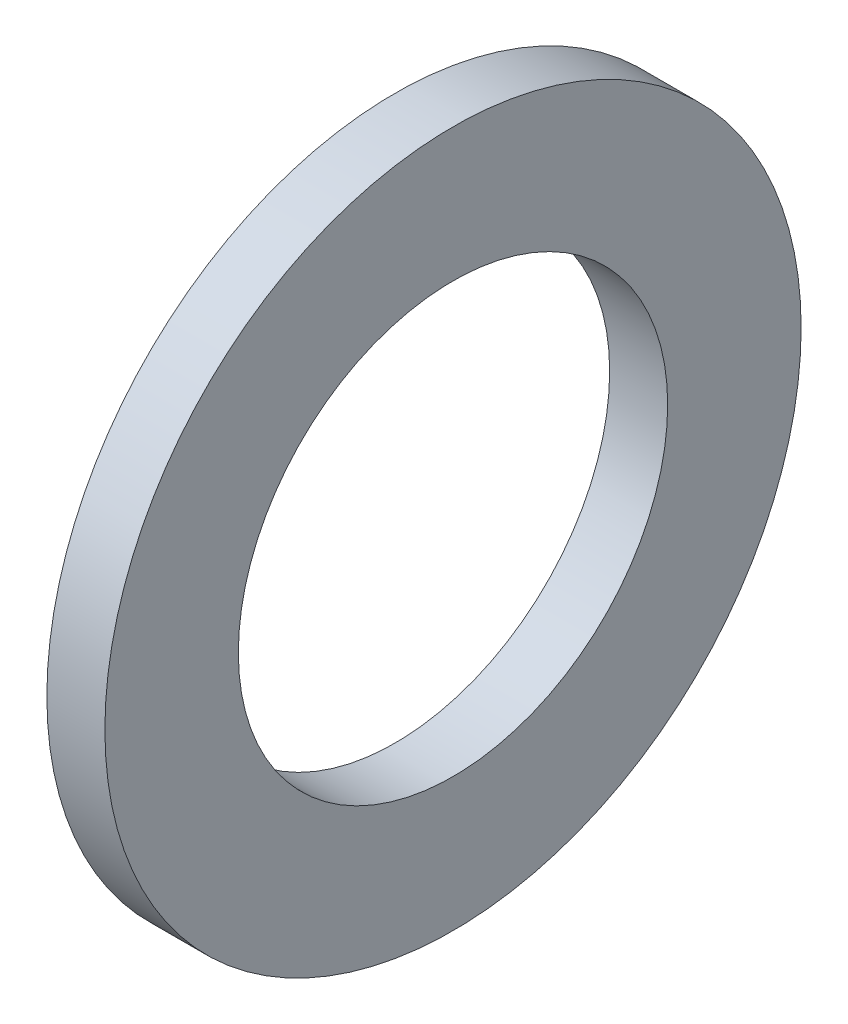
ISO-10303-21;
HEADER;
FILE_DESCRIPTION(('STEP AP214'),'2;1');
FILE_NAME('part.step','',(''),(''),'','','');
FILE_SCHEMA(('AUTOMOTIVE_DESIGN { 1 0 10303 214 1 1 1 1 }'));
ENDSEC;
DATA;
#1=APPLICATION_CONTEXT('core data for automotive mechanical design processes');
#2=APPLICATION_PROTOCOL_DEFINITION('international standard','automotive_design',2000,#1);
#3=PRODUCT_CONTEXT('',#1,'mechanical');
#4=PRODUCT('Part','Part','',(#3));
#5=PRODUCT_RELATED_PRODUCT_CATEGORY('part','',(#4));
#6=PRODUCT_DEFINITION_FORMATION('','',#4);
#7=PRODUCT_DEFINITION_CONTEXT('part definition',#1,'design');
#8=PRODUCT_DEFINITION('design','',#6,#7);
#9=PRODUCT_DEFINITION_SHAPE('','',#8);
#10=(LENGTH_UNIT() NAMED_UNIT(*) SI_UNIT(.MILLI.,.METRE.));
#11=(NAMED_UNIT(*) PLANE_ANGLE_UNIT() SI_UNIT($,.RADIAN.));
#12=(NAMED_UNIT(*) SI_UNIT($,.STERADIAN.) SOLID_ANGLE_UNIT());
#13=UNCERTAINTY_MEASURE_WITH_UNIT(LENGTH_MEASURE(1.E-05),#10,'distance_accuracy_value','');
#14=(GEOMETRIC_REPRESENTATION_CONTEXT(3) GLOBAL_UNCERTAINTY_ASSIGNED_CONTEXT((#13)) GLOBAL_UNIT_ASSIGNED_CONTEXT((#10,
#11,#12)) REPRESENTATION_CONTEXT('',''));
#15=CARTESIAN_POINT('',(0.,0.,0.));
#16=DIRECTION('',(0.,0.,1.));
#17=DIRECTION('',(1.,0.,0.));
#18=AXIS2_PLACEMENT_3D('',#15,#16,#17);
#19=CARTESIAN_POINT('',(-34.9249999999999,0.,0.));
#20=DIRECTION('',(-1.,0.,0.));
#21=DIRECTION('',(0.,0.,1.));
#22=AXIS2_PLACEMENT_3D('',#19,#20,#21);
#23=CYLINDRICAL_SURFACE('',#22,18.5);
#24=CARTESIAN_POINT('',(0.,0.,0.));
#25=DIRECTION('',(-1.,0.,0.));
#26=DIRECTION('',(0.,0.,1.));
#27=AXIS2_PLACEMENT_3D('',#24,#25,#26);
#28=CIRCLE('',#27,18.5);
#29=CARTESIAN_POINT('',(0.,0.,18.5));
#30=VERTEX_POINT('',#29);
#31=EDGE_CURVE('E10',#30,#30,#28,.T.);
#32=ORIENTED_EDGE('',*,*,#31,.F.);
#33=EDGE_LOOP('',(#32));
#34=FACE_BOUND('',#33,.T.);
#35=CARTESIAN_POINT('',(-5.,0.,0.));
#36=DIRECTION('',(-1.,0.,0.));
#37=DIRECTION('',(0.,0.,1.));
#38=AXIS2_PLACEMENT_3D('',#35,#36,#37);
#39=CIRCLE('',#38,18.5);
#40=CARTESIAN_POINT('',(-5.,0.,18.5));
#41=VERTEX_POINT('',#40);
#42=EDGE_CURVE('E45',#41,#41,#39,.T.);
#43=ORIENTED_EDGE('',*,*,#42,.T.);
#44=EDGE_LOOP('',(#43));
#45=FACE_BOUND('',#44,.T.);
#46=ADVANCED_FACE('F31',(#34,#45),#23,.F.);
#47=CARTESIAN_POINT('',(0.,18.5,0.));
#48=DIRECTION('',(-1.,0.,0.));
#49=DIRECTION('',(0.,0.,1.));
#50=AXIS2_PLACEMENT_3D('',#47,#48,#49);
#51=PLANE('',#50);
#52=CARTESIAN_POINT('',(0.,0.,0.));
#53=DIRECTION('',(-1.,0.,0.));
#54=DIRECTION('',(0.,0.,1.));
#55=AXIS2_PLACEMENT_3D('',#52,#53,#54);
#56=CIRCLE('',#55,30.);
#57=CARTESIAN_POINT('',(0.,0.,30.));
#58=VERTEX_POINT('',#57);
#59=EDGE_CURVE('E37',#58,#58,#56,.T.);
#60=ORIENTED_EDGE('',*,*,#59,.F.);
#61=EDGE_LOOP('',(#60));
#62=FACE_BOUND('',#61,.T.);
#63=ORIENTED_EDGE('',*,*,#31,.T.);
#64=EDGE_LOOP('',(#63));
#65=FACE_BOUND('',#64,.T.);
#66=ADVANCED_FACE('F60',(#62,#65),#51,.F.);
#67=CARTESIAN_POINT('',(-34.9249999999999,0.,0.));
#68=DIRECTION('',(-1.,0.,0.));
#69=DIRECTION('',(0.,0.,1.));
#70=AXIS2_PLACEMENT_3D('',#67,#68,#69);
#71=CYLINDRICAL_SURFACE('',#70,30.);
#72=CARTESIAN_POINT('',(-5.,0.,0.));
#73=DIRECTION('',(-1.,0.,0.));
#74=DIRECTION('',(0.,0.,1.));
#75=AXIS2_PLACEMENT_3D('',#72,#73,#74);
#76=CIRCLE('',#75,30.);
#77=CARTESIAN_POINT('',(-5.,0.,30.));
#78=VERTEX_POINT('',#77);
#79=EDGE_CURVE('E41',#78,#78,#76,.T.);
#80=ORIENTED_EDGE('',*,*,#79,.F.);
#81=EDGE_LOOP('',(#80));
#82=FACE_BOUND('',#81,.T.);
#83=ORIENTED_EDGE('',*,*,#59,.T.);
#84=EDGE_LOOP('',(#83));
#85=FACE_BOUND('',#84,.T.);
#86=ADVANCED_FACE('F55',(#82,#85),#71,.T.);
#87=CARTESIAN_POINT('',(-5.,30.,0.));
#88=DIRECTION('',(1.,0.,0.));
#89=DIRECTION('',(0.,0.,-1.));
#90=AXIS2_PLACEMENT_3D('',#87,#88,#89);
#91=PLANE('',#90);
#92=ORIENTED_EDGE('',*,*,#42,.F.);
#93=EDGE_LOOP('',(#92));
#94=FACE_BOUND('',#93,.T.);
#95=ORIENTED_EDGE('',*,*,#79,.T.);
#96=EDGE_LOOP('',(#95));
#97=FACE_BOUND('',#96,.T.);
#98=ADVANCED_FACE('F52',(#94,#97),#91,.F.);
#99=CLOSED_SHELL('',(#46,#66,#86,#98));
#100=MANIFOLD_SOLID_BREP('B2',#99);
#101=ADVANCED_BREP_SHAPE_REPRESENTATION('',(#18,#100),#14);
#102=SHAPE_DEFINITION_REPRESENTATION(#9,#101);
ENDSEC;
END-ISO-10303-21;
